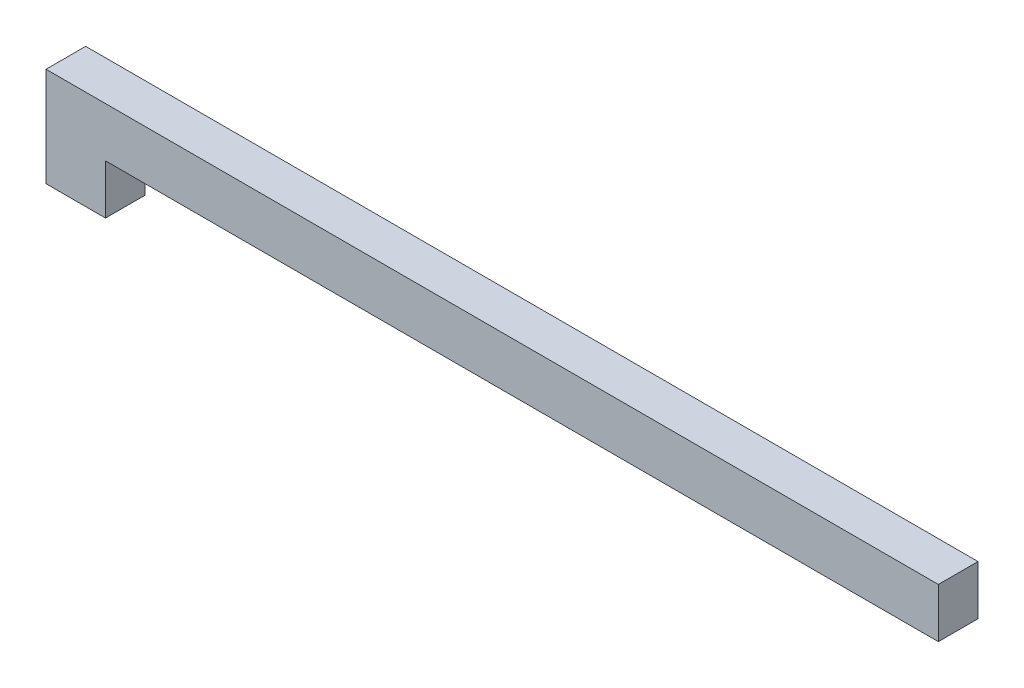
ISO-10303-21;
HEADER;
FILE_DESCRIPTION(('STEP AP214'),'2;1');
FILE_NAME('part.step','',(''),(''),'','','');
FILE_SCHEMA(('AUTOMOTIVE_DESIGN { 1 0 10303 214 1 1 1 1 }'));
ENDSEC;
DATA;
#1=APPLICATION_CONTEXT('core data for automotive mechanical design processes');
#2=APPLICATION_PROTOCOL_DEFINITION('international standard','automotive_design',2000,#1);
#3=PRODUCT_CONTEXT('',#1,'mechanical');
#4=PRODUCT('Part','Part','',(#3));
#5=PRODUCT_RELATED_PRODUCT_CATEGORY('part','',(#4));
#6=PRODUCT_DEFINITION_FORMATION('','',#4);
#7=PRODUCT_DEFINITION_CONTEXT('part definition',#1,'design');
#8=PRODUCT_DEFINITION('design','',#6,#7);
#9=PRODUCT_DEFINITION_SHAPE('','',#8);
#10=(LENGTH_UNIT() NAMED_UNIT(*) SI_UNIT(.MILLI.,.METRE.));
#11=(NAMED_UNIT(*) PLANE_ANGLE_UNIT() SI_UNIT($,.RADIAN.));
#12=(NAMED_UNIT(*) SI_UNIT($,.STERADIAN.) SOLID_ANGLE_UNIT());
#13=UNCERTAINTY_MEASURE_WITH_UNIT(LENGTH_MEASURE(1.E-05),#10,'distance_accuracy_value','');
#14=(GEOMETRIC_REPRESENTATION_CONTEXT(3) GLOBAL_UNCERTAINTY_ASSIGNED_CONTEXT((#13)) GLOBAL_UNIT_ASSIGNED_CONTEXT((#10,
#11,#12)) REPRESENTATION_CONTEXT('',''));
#15=CARTESIAN_POINT('',(0.,0.,0.));
#16=DIRECTION('',(0.,0.,1.));
#17=DIRECTION('',(1.,0.,0.));
#18=AXIS2_PLACEMENT_3D('',#15,#16,#17);
#19=CARTESIAN_POINT('',(42.,0.,2.));
#20=DIRECTION('',(0.,1.,0.));
#21=DIRECTION('',(-1.,0.,0.));
#22=AXIS2_PLACEMENT_3D('',#19,#20,#21);
#23=PLANE('',#22);
#24=DIRECTION('',(1.,0.,0.));
#25=VECTOR('',#24,1.);
#26=CARTESIAN_POINT('',(42.,0.,0.));
#27=LINE('',#26,#25);
#28=CARTESIAN_POINT('',(0.,0.,0.));
#29=VERTEX_POINT('',#28);
#30=CARTESIAN_POINT('',(42.,0.,0.));
#31=VERTEX_POINT('',#30);
#32=EDGE_CURVE('E117',#29,#31,#27,.T.);
#33=ORIENTED_EDGE('',*,*,#32,.T.);
#34=DIRECTION('',(0.,0.,-1.));
#35=VECTOR('',#34,1.);
#36=CARTESIAN_POINT('',(42.,0.,2.));
#37=LINE('',#36,#35);
#38=CARTESIAN_POINT('',(42.,0.,2.));
#39=VERTEX_POINT('',#38);
#40=EDGE_CURVE('E11',#39,#31,#37,.T.);
#41=ORIENTED_EDGE('',*,*,#40,.F.);
#42=DIRECTION('',(1.,0.,0.));
#43=VECTOR('',#42,1.);
#44=CARTESIAN_POINT('',(42.,0.,2.));
#45=LINE('',#44,#43);
#46=CARTESIAN_POINT('',(0.,0.,2.));
#47=VERTEX_POINT('',#46);
#48=EDGE_CURVE('E127',#47,#39,#45,.T.);
#49=ORIENTED_EDGE('',*,*,#48,.F.);
#50=DIRECTION('',(0.,0.,-1.));
#51=VECTOR('',#50,1.);
#52=CARTESIAN_POINT('',(0.,0.,2.));
#53=LINE('',#52,#51);
#54=EDGE_CURVE('E113',#47,#29,#53,.T.);
#55=ORIENTED_EDGE('',*,*,#54,.T.);
#56=EDGE_LOOP('',(#33,#41,#49,#55));
#57=FACE_BOUND('',#56,.T.);
#58=ADVANCED_FACE('F33',(#57),#23,.F.);
#59=CARTESIAN_POINT('',(42.,2.50000000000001,2.));
#60=DIRECTION('',(-1.,0.,0.));
#61=DIRECTION('',(0.,0.,1.));
#62=AXIS2_PLACEMENT_3D('',#59,#60,#61);
#63=PLANE('',#62);
#64=DIRECTION('',(0.,1.,0.));
#65=VECTOR('',#64,1.);
#66=CARTESIAN_POINT('',(42.,2.50000000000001,0.));
#67=LINE('',#66,#65);
#68=CARTESIAN_POINT('',(42.,2.50000000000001,0.));
#69=VERTEX_POINT('',#68);
#70=EDGE_CURVE('E120',#31,#69,#67,.T.);
#71=ORIENTED_EDGE('',*,*,#70,.T.);
#72=DIRECTION('',(0.,0.,-1.));
#73=VECTOR('',#72,1.);
#74=CARTESIAN_POINT('',(42.,2.50000000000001,2.));
#75=LINE('',#74,#73);
#76=CARTESIAN_POINT('',(42.,2.50000000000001,2.));
#77=VERTEX_POINT('',#76);
#78=EDGE_CURVE('E41',#77,#69,#75,.T.);
#79=ORIENTED_EDGE('',*,*,#78,.F.);
#80=DIRECTION('',(0.,1.,0.));
#81=VECTOR('',#80,1.);
#82=CARTESIAN_POINT('',(42.,2.50000000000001,2.));
#83=LINE('',#82,#81);
#84=EDGE_CURVE('E86',#39,#77,#83,.T.);
#85=ORIENTED_EDGE('',*,*,#84,.F.);
#86=ORIENTED_EDGE('',*,*,#40,.T.);
#87=EDGE_LOOP('',(#71,#79,#85,#86));
#88=FACE_BOUND('',#87,.T.);
#89=ADVANCED_FACE('F151',(#88),#63,.F.);
#90=CARTESIAN_POINT('',(-3.,2.50000000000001,2.));
#91=DIRECTION('',(0.,-1.,0.));
#92=DIRECTION('',(1.,0.,0.));
#93=AXIS2_PLACEMENT_3D('',#90,#91,#92);
#94=PLANE('',#93);
#95=DIRECTION('',(-1.,0.,0.));
#96=VECTOR('',#95,1.);
#97=CARTESIAN_POINT('',(-3.,2.50000000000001,0.));
#98=LINE('',#97,#96);
#99=CARTESIAN_POINT('',(-3.,2.50000000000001,0.));
#100=VERTEX_POINT('',#99);
#101=EDGE_CURVE('E122',#69,#100,#98,.T.);
#102=ORIENTED_EDGE('',*,*,#101,.T.);
#103=DIRECTION('',(0.,0.,-1.));
#104=VECTOR('',#103,1.);
#105=CARTESIAN_POINT('',(-3.,2.50000000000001,2.));
#106=LINE('',#105,#104);
#107=CARTESIAN_POINT('',(-3.,2.50000000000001,2.));
#108=VERTEX_POINT('',#107);
#109=EDGE_CURVE('E108',#108,#100,#106,.T.);
#110=ORIENTED_EDGE('',*,*,#109,.F.);
#111=DIRECTION('',(-1.,0.,0.));
#112=VECTOR('',#111,1.);
#113=CARTESIAN_POINT('',(-3.,2.50000000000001,2.));
#114=LINE('',#113,#112);
#115=EDGE_CURVE('E99',#77,#108,#114,.T.);
#116=ORIENTED_EDGE('',*,*,#115,.F.);
#117=ORIENTED_EDGE('',*,*,#78,.T.);
#118=EDGE_LOOP('',(#102,#110,#116,#117));
#119=FACE_BOUND('',#118,.T.);
#120=ADVANCED_FACE('F133',(#119),#94,.F.);
#121=CARTESIAN_POINT('',(-3.,-2.49999999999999,2.));
#122=DIRECTION('',(1.,0.,0.));
#123=DIRECTION('',(0.,1.,0.));
#124=AXIS2_PLACEMENT_3D('',#121,#122,#123);
#125=PLANE('',#124);
#126=DIRECTION('',(0.,-1.,0.));
#127=VECTOR('',#126,1.);
#128=CARTESIAN_POINT('',(-3.,-2.49999999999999,0.));
#129=LINE('',#128,#127);
#130=CARTESIAN_POINT('',(-3.,-2.49999999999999,0.));
#131=VERTEX_POINT('',#130);
#132=EDGE_CURVE('E107',#100,#131,#129,.T.);
#133=ORIENTED_EDGE('',*,*,#132,.T.);
#134=DIRECTION('',(0.,0.,-1.));
#135=VECTOR('',#134,1.);
#136=CARTESIAN_POINT('',(-3.,-2.49999999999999,2.));
#137=LINE('',#136,#135);
#138=CARTESIAN_POINT('',(-3.,-2.49999999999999,2.));
#139=VERTEX_POINT('',#138);
#140=EDGE_CURVE('E104',#139,#131,#137,.T.);
#141=ORIENTED_EDGE('',*,*,#140,.F.);
#142=DIRECTION('',(0.,-1.,0.));
#143=VECTOR('',#142,1.);
#144=CARTESIAN_POINT('',(-3.,-2.49999999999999,2.));
#145=LINE('',#144,#143);
#146=EDGE_CURVE('E93',#108,#139,#145,.T.);
#147=ORIENTED_EDGE('',*,*,#146,.F.);
#148=ORIENTED_EDGE('',*,*,#109,.T.);
#149=EDGE_LOOP('',(#133,#141,#147,#148));
#150=FACE_BOUND('',#149,.T.);
#151=ADVANCED_FACE('F105',(#150),#125,.F.);
#152=CARTESIAN_POINT('',(0.,-2.5,2.));
#153=DIRECTION('',(0.,1.,0.));
#154=DIRECTION('',(-1.,0.,0.));
#155=AXIS2_PLACEMENT_3D('',#152,#153,#154);
#156=PLANE('',#155);
#157=DIRECTION('',(1.,0.,0.));
#158=VECTOR('',#157,1.);
#159=CARTESIAN_POINT('',(0.,-2.5,0.));
#160=LINE('',#159,#158);
#161=CARTESIAN_POINT('',(0.,-2.5,0.));
#162=VERTEX_POINT('',#161);
#163=EDGE_CURVE('E72',#131,#162,#160,.T.);
#164=ORIENTED_EDGE('',*,*,#163,.T.);
#165=DIRECTION('',(0.,0.,-1.));
#166=VECTOR('',#165,1.);
#167=CARTESIAN_POINT('',(0.,-2.5,2.));
#168=LINE('',#167,#166);
#169=CARTESIAN_POINT('',(0.,-2.5,2.));
#170=VERTEX_POINT('',#169);
#171=EDGE_CURVE('E109',#170,#162,#168,.T.);
#172=ORIENTED_EDGE('',*,*,#171,.F.);
#173=DIRECTION('',(1.,0.,0.));
#174=VECTOR('',#173,1.);
#175=CARTESIAN_POINT('',(0.,-2.5,2.));
#176=LINE('',#175,#174);
#177=EDGE_CURVE('E97',#139,#170,#176,.T.);
#178=ORIENTED_EDGE('',*,*,#177,.F.);
#179=ORIENTED_EDGE('',*,*,#140,.T.);
#180=EDGE_LOOP('',(#164,#172,#178,#179));
#181=FACE_BOUND('',#180,.T.);
#182=ADVANCED_FACE('F111',(#181),#156,.F.);
#183=CARTESIAN_POINT('',(0.,0.,2.));
#184=DIRECTION('',(-1.,0.,0.));
#185=DIRECTION('',(0.,-1.,0.));
#186=AXIS2_PLACEMENT_3D('',#183,#184,#185);
#187=PLANE('',#186);
#188=DIRECTION('',(0.,1.,0.));
#189=VECTOR('',#188,1.);
#190=CARTESIAN_POINT('',(0.,0.,0.));
#191=LINE('',#190,#189);
#192=EDGE_CURVE('E78',#162,#29,#191,.T.);
#193=ORIENTED_EDGE('',*,*,#192,.T.);
#194=ORIENTED_EDGE('',*,*,#54,.F.);
#195=DIRECTION('',(0.,1.,0.));
#196=VECTOR('',#195,1.);
#197=CARTESIAN_POINT('',(0.,0.,2.));
#198=LINE('',#197,#196);
#199=EDGE_CURVE('E49',#170,#47,#198,.T.);
#200=ORIENTED_EDGE('',*,*,#199,.F.);
#201=ORIENTED_EDGE('',*,*,#171,.T.);
#202=EDGE_LOOP('',(#193,#194,#200,#201));
#203=FACE_BOUND('',#202,.T.);
#204=ADVANCED_FACE('F140',(#203),#187,.F.);
#205=CARTESIAN_POINT('',(0.,0.,2.));
#206=DIRECTION('',(0.,0.,1.));
#207=DIRECTION('',(1.,0.,0.));
#208=AXIS2_PLACEMENT_3D('',#205,#206,#207);
#209=PLANE('',#208);
#210=ORIENTED_EDGE('',*,*,#48,.T.);
#211=ORIENTED_EDGE('',*,*,#84,.T.);
#212=ORIENTED_EDGE('',*,*,#115,.T.);
#213=ORIENTED_EDGE('',*,*,#146,.T.);
#214=ORIENTED_EDGE('',*,*,#177,.T.);
#215=ORIENTED_EDGE('',*,*,#199,.T.);
#216=EDGE_LOOP('',(#210,#211,#212,#213,#214,#215));
#217=FACE_BOUND('',#216,.T.);
#218=ADVANCED_FACE('F95',(#217),#209,.T.);
#219=CARTESIAN_POINT('',(0.,0.,0.));
#220=DIRECTION('',(0.,0.,1.));
#221=DIRECTION('',(1.,0.,0.));
#222=AXIS2_PLACEMENT_3D('',#219,#220,#221);
#223=PLANE('',#222);
#224=ORIENTED_EDGE('',*,*,#32,.F.);
#225=ORIENTED_EDGE('',*,*,#192,.F.);
#226=ORIENTED_EDGE('',*,*,#163,.F.);
#227=ORIENTED_EDGE('',*,*,#132,.F.);
#228=ORIENTED_EDGE('',*,*,#101,.F.);
#229=ORIENTED_EDGE('',*,*,#70,.F.);
#230=EDGE_LOOP('',(#224,#225,#226,#227,#228,#229));
#231=FACE_BOUND('',#230,.T.);
#232=ADVANCED_FACE('F136',(#231),#223,.F.);
#233=CLOSED_SHELL('',(#58,#89,#120,#151,#182,#204,#218,#232));
#234=MANIFOLD_SOLID_BREP('B2',#233);
#235=ADVANCED_BREP_SHAPE_REPRESENTATION('',(#18,#234),#14);
#236=SHAPE_DEFINITION_REPRESENTATION(#9,#235);
ENDSEC;
END-ISO-10303-21;
